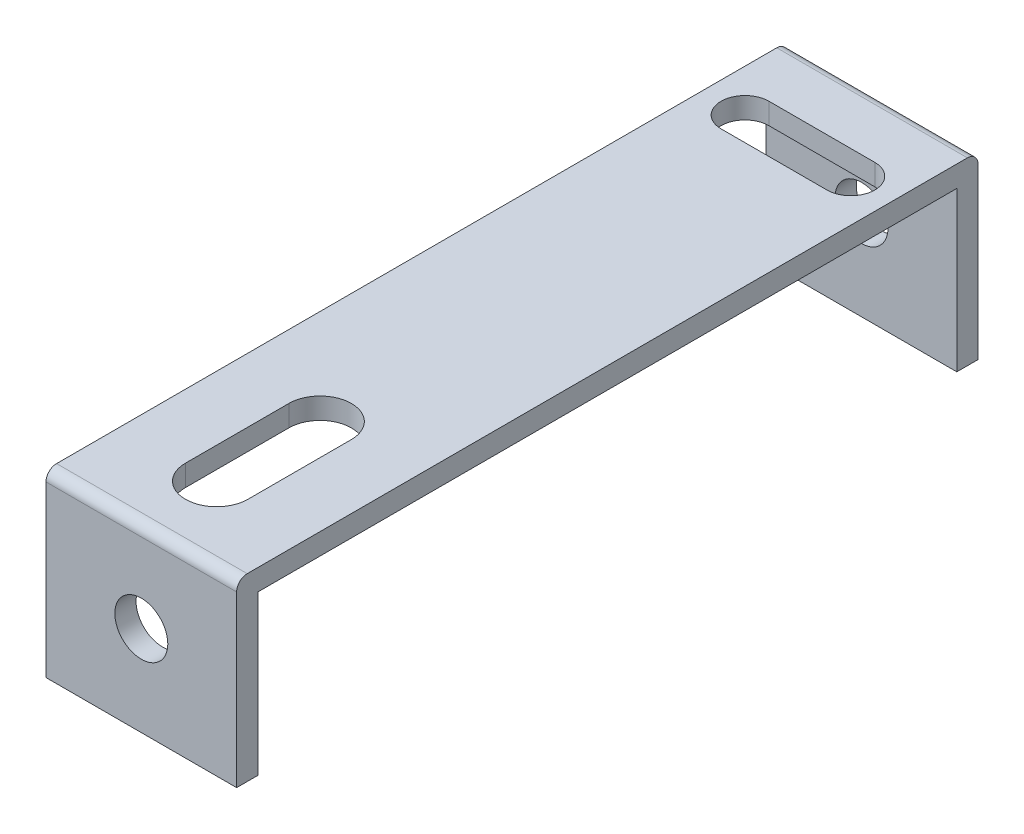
ISO-10303-21;
HEADER;
FILE_DESCRIPTION(('STEP AP214'),'2;1');
FILE_NAME('part.step','',(''),(''),'','','');
FILE_SCHEMA(('AUTOMOTIVE_DESIGN { 1 0 10303 214 1 1 1 1 }'));
ENDSEC;
DATA;
#1=APPLICATION_CONTEXT('core data for automotive mechanical design processes');
#2=APPLICATION_PROTOCOL_DEFINITION('international standard','automotive_design',2000,#1);
#3=PRODUCT_CONTEXT('',#1,'mechanical');
#4=PRODUCT('Part','Part','',(#3));
#5=PRODUCT_RELATED_PRODUCT_CATEGORY('part','',(#4));
#6=PRODUCT_DEFINITION_FORMATION('','',#4);
#7=PRODUCT_DEFINITION_CONTEXT('part definition',#1,'design');
#8=PRODUCT_DEFINITION('design','',#6,#7);
#9=PRODUCT_DEFINITION_SHAPE('','',#8);
#10=(LENGTH_UNIT() NAMED_UNIT(*) SI_UNIT(.MILLI.,.METRE.));
#11=(NAMED_UNIT(*) PLANE_ANGLE_UNIT() SI_UNIT($,.RADIAN.));
#12=(NAMED_UNIT(*) SI_UNIT($,.STERADIAN.) SOLID_ANGLE_UNIT());
#13=UNCERTAINTY_MEASURE_WITH_UNIT(LENGTH_MEASURE(1.E-05),#10,'distance_accuracy_value','');
#14=(GEOMETRIC_REPRESENTATION_CONTEXT(3) GLOBAL_UNCERTAINTY_ASSIGNED_CONTEXT((#13)) GLOBAL_UNIT_ASSIGNED_CONTEXT((#10,
#11,#12)) REPRESENTATION_CONTEXT('',''));
#15=CARTESIAN_POINT('',(0.,0.,0.));
#16=DIRECTION('',(0.,0.,1.));
#17=DIRECTION('',(1.,0.,0.));
#18=AXIS2_PLACEMENT_3D('',#15,#16,#17);
#19=CARTESIAN_POINT('',(18.,0.,-38.));
#20=DIRECTION('',(0.,0.,1.));
#21=DIRECTION('',(1.,0.,0.));
#22=AXIS2_PLACEMENT_3D('',#19,#20,#21);
#23=PLANE('',#22);
#24=CARTESIAN_POINT('',(8.99999999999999,-8.49999999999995,-38.));
#25=DIRECTION('',(0.,0.,1.));
#26=DIRECTION('',(1.,0.,0.));
#27=AXIS2_PLACEMENT_3D('',#24,#25,#26);
#28=CIRCLE('',#27,2.5);
#29=CARTESIAN_POINT('',(11.5,-8.49999999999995,-38.));
#30=VERTEX_POINT('',#29);
#31=EDGE_CURVE('E225',#30,#30,#28,.T.);
#32=ORIENTED_EDGE('',*,*,#31,.T.);
#33=EDGE_LOOP('',(#32));
#34=FACE_BOUND('',#33,.T.);
#35=DIRECTION('',(0.,1.,0.));
#36=VECTOR('',#35,1.);
#37=CARTESIAN_POINT('',(0.,0.,-38.));
#38=LINE('',#37,#36);
#39=CARTESIAN_POINT('',(0.,-16.9999999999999,-38.));
#40=VERTEX_POINT('',#39);
#41=CARTESIAN_POINT('',(0.,-0.99999999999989,-38.));
#42=VERTEX_POINT('',#41);
#43=EDGE_CURVE('E232',#40,#42,#38,.T.);
#44=ORIENTED_EDGE('',*,*,#43,.T.);
#45=DIRECTION('',(-1.,0.,0.));
#46=VECTOR('',#45,1.);
#47=CARTESIAN_POINT('',(18.,-0.99999999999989,-38.));
#48=LINE('',#47,#46);
#49=CARTESIAN_POINT('',(18.,-0.99999999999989,-38.));
#50=VERTEX_POINT('',#49);
#51=EDGE_CURVE('E297',#42,#50,#48,.F.);
#52=ORIENTED_EDGE('',*,*,#51,.T.);
#53=DIRECTION('',(0.,1.,0.));
#54=VECTOR('',#53,1.);
#55=CARTESIAN_POINT('',(18.,0.,-38.));
#56=LINE('',#55,#54);
#57=CARTESIAN_POINT('',(18.,-16.9999999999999,-38.));
#58=VERTEX_POINT('',#57);
#59=EDGE_CURVE('E233',#58,#50,#56,.T.);
#60=ORIENTED_EDGE('',*,*,#59,.F.);
#61=DIRECTION('',(-1.,0.,0.));
#62=VECTOR('',#61,1.);
#63=CARTESIAN_POINT('',(18.,-16.9999999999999,-38.));
#64=LINE('',#63,#62);
#65=EDGE_CURVE('E252',#58,#40,#64,.T.);
#66=ORIENTED_EDGE('',*,*,#65,.T.);
#67=EDGE_LOOP('',(#44,#52,#60,#66));
#68=FACE_BOUND('',#67,.T.);
#69=ADVANCED_FACE('F46',(#34,#68),#23,.F.);
#70=CARTESIAN_POINT('',(18.,0.,32.));
#71=DIRECTION('',(0.,-1.,0.));
#72=DIRECTION('',(0.,0.,-1.));
#73=AXIS2_PLACEMENT_3D('',#70,#71,#72);
#74=PLANE('',#73);
#75=DIRECTION('',(-1.,0.,0.));
#76=VECTOR('',#75,1.);
#77=CARTESIAN_POINT('',(14.,0.,-32.2595339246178));
#78=LINE('',#77,#76);
#79=CARTESIAN_POINT('',(14.,0.,-32.2595339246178));
#80=VERTEX_POINT('',#79);
#81=CARTESIAN_POINT('',(4.,0.,-32.2595339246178));
#82=VERTEX_POINT('',#81);
#83=EDGE_CURVE('E188',#80,#82,#78,.T.);
#84=ORIENTED_EDGE('',*,*,#83,.F.);
#85=CARTESIAN_POINT('',(14.,0.,-30.));
#86=DIRECTION('',(0.,1.,0.));
#87=DIRECTION('',(0.,0.,1.));
#88=AXIS2_PLACEMENT_3D('',#85,#86,#87);
#89=CIRCLE('',#88,2.25953392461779);
#90=CARTESIAN_POINT('',(14.,0.,-27.7404660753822));
#91=VERTEX_POINT('',#90);
#92=EDGE_CURVE('E61',#91,#80,#89,.T.);
#93=ORIENTED_EDGE('',*,*,#92,.F.);
#94=DIRECTION('',(1.,0.,0.));
#95=VECTOR('',#94,1.);
#96=CARTESIAN_POINT('',(14.,0.,-27.7404660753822));
#97=LINE('',#96,#95);
#98=CARTESIAN_POINT('',(3.99999999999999,0.,-27.7404660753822));
#99=VERTEX_POINT('',#98);
#100=EDGE_CURVE('E195',#99,#91,#97,.T.);
#101=ORIENTED_EDGE('',*,*,#100,.F.);
#102=CARTESIAN_POINT('',(4.,0.,-30.));
#103=DIRECTION('',(0.,1.,0.));
#104=DIRECTION('',(0.,0.,1.));
#105=AXIS2_PLACEMENT_3D('',#102,#103,#104);
#106=CIRCLE('',#105,2.25953392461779);
#107=EDGE_CURVE('E178',#82,#99,#106,.T.);
#108=ORIENTED_EDGE('',*,*,#107,.F.);
#109=EDGE_LOOP('',(#84,#93,#101,#108));
#110=FACE_BOUND('',#109,.T.);
#111=DIRECTION('',(0.,0.,-1.));
#112=VECTOR('',#111,1.);
#113=CARTESIAN_POINT('',(11.9516802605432,0.,24.8840557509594));
#114=LINE('',#113,#112);
#115=CARTESIAN_POINT('',(11.9516802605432,0.,24.8840557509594));
#116=VERTEX_POINT('',#115);
#117=CARTESIAN_POINT('',(11.9516802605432,0.,15.1159442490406));
#118=VERTEX_POINT('',#117);
#119=EDGE_CURVE('E206',#116,#118,#114,.T.);
#120=ORIENTED_EDGE('',*,*,#119,.F.);
#121=CARTESIAN_POINT('',(8.99999999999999,0.,24.8840557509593));
#122=DIRECTION('',(0.,1.,0.));
#123=DIRECTION('',(0.,0.,1.));
#124=AXIS2_PLACEMENT_3D('',#121,#122,#123);
#125=CIRCLE('',#124,2.95168026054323);
#126=CARTESIAN_POINT('',(6.04831973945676,0.,24.8840557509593));
#127=VERTEX_POINT('',#126);
#128=EDGE_CURVE('E69',#127,#116,#125,.T.);
#129=ORIENTED_EDGE('',*,*,#128,.F.);
#130=DIRECTION('',(0.,0.,1.));
#131=VECTOR('',#130,1.);
#132=CARTESIAN_POINT('',(6.04831973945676,0.,24.8840557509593));
#133=LINE('',#132,#131);
#134=CARTESIAN_POINT('',(6.04831973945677,0.,15.1159442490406));
#135=VERTEX_POINT('',#134);
#136=EDGE_CURVE('E212',#135,#127,#133,.T.);
#137=ORIENTED_EDGE('',*,*,#136,.F.);
#138=CARTESIAN_POINT('',(8.99999999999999,0.,15.1159442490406));
#139=DIRECTION('',(0.,1.,0.));
#140=DIRECTION('',(0.,0.,1.));
#141=AXIS2_PLACEMENT_3D('',#138,#139,#140);
#142=CIRCLE('',#141,2.95168026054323);
#143=EDGE_CURVE('E209',#118,#135,#142,.T.);
#144=ORIENTED_EDGE('',*,*,#143,.F.);
#145=EDGE_LOOP('',(#120,#129,#137,#144));
#146=FACE_BOUND('',#145,.T.);
#147=DIRECTION('',(0.,0.,1.));
#148=VECTOR('',#147,1.);
#149=CARTESIAN_POINT('',(18.,0.,32.));
#150=LINE('',#149,#148);
#151=CARTESIAN_POINT('',(18.,0.,-37.));
#152=VERTEX_POINT('',#151);
#153=CARTESIAN_POINT('',(18.,0.,31.));
#154=VERTEX_POINT('',#153);
#155=EDGE_CURVE('E236',#152,#154,#150,.T.);
#156=ORIENTED_EDGE('',*,*,#155,.F.);
#157=DIRECTION('',(-1.,0.,0.));
#158=VECTOR('',#157,1.);
#159=CARTESIAN_POINT('',(18.,0.,-37.));
#160=LINE('',#159,#158);
#161=CARTESIAN_POINT('',(0.,0.,-37.));
#162=VERTEX_POINT('',#161);
#163=EDGE_CURVE('E290',#152,#162,#160,.T.);
#164=ORIENTED_EDGE('',*,*,#163,.T.);
#165=DIRECTION('',(0.,0.,1.));
#166=VECTOR('',#165,1.);
#167=CARTESIAN_POINT('',(0.,0.,32.0000000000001));
#168=LINE('',#167,#166);
#169=CARTESIAN_POINT('',(0.,0.,31.));
#170=VERTEX_POINT('',#169);
#171=EDGE_CURVE('E255',#162,#170,#168,.T.);
#172=ORIENTED_EDGE('',*,*,#171,.T.);
#173=DIRECTION('',(-1.,0.,0.));
#174=VECTOR('',#173,1.);
#175=CARTESIAN_POINT('',(18.,0.,31.));
#176=LINE('',#175,#174);
#177=EDGE_CURVE('E286',#170,#154,#176,.F.);
#178=ORIENTED_EDGE('',*,*,#177,.T.);
#179=EDGE_LOOP('',(#156,#164,#172,#178));
#180=FACE_BOUND('',#179,.T.);
#181=ADVANCED_FACE('F192',(#110,#146,#180),#74,.F.);
#182=CARTESIAN_POINT('',(18.,0.,32.));
#183=DIRECTION('',(0.,0.,-1.));
#184=DIRECTION('',(-1.,0.,0.));
#185=AXIS2_PLACEMENT_3D('',#182,#183,#184);
#186=PLANE('',#185);
#187=CARTESIAN_POINT('',(8.99999999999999,-8.49999999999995,32.));
#188=DIRECTION('',(0.,0.,1.));
#189=DIRECTION('',(1.,0.,0.));
#190=AXIS2_PLACEMENT_3D('',#187,#188,#189);
#191=CIRCLE('',#190,2.5);
#192=CARTESIAN_POINT('',(11.5,-8.49999999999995,32.));
#193=VERTEX_POINT('',#192);
#194=EDGE_CURVE('E202',#193,#193,#191,.T.);
#195=ORIENTED_EDGE('',*,*,#194,.F.);
#196=EDGE_LOOP('',(#195));
#197=FACE_BOUND('',#196,.T.);
#198=DIRECTION('',(0.,-1.,0.));
#199=VECTOR('',#198,1.);
#200=CARTESIAN_POINT('',(18.,0.,32.));
#201=LINE('',#200,#199);
#202=CARTESIAN_POINT('',(18.,-1.00000000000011,32.));
#203=VERTEX_POINT('',#202);
#204=CARTESIAN_POINT('',(18.,-17.0000000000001,32.));
#205=VERTEX_POINT('',#204);
#206=EDGE_CURVE('E240',#203,#205,#201,.T.);
#207=ORIENTED_EDGE('',*,*,#206,.F.);
#208=DIRECTION('',(-1.,0.,0.));
#209=VECTOR('',#208,1.);
#210=CARTESIAN_POINT('',(18.,-1.00000000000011,32.));
#211=LINE('',#210,#209);
#212=CARTESIAN_POINT('',(0.,-1.00000000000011,32.0000000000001));
#213=VERTEX_POINT('',#212);
#214=EDGE_CURVE('E303',#203,#213,#211,.T.);
#215=ORIENTED_EDGE('',*,*,#214,.T.);
#216=DIRECTION('',(0.,-1.,0.));
#217=VECTOR('',#216,1.);
#218=CARTESIAN_POINT('',(0.,0.,32.0000000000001));
#219=LINE('',#218,#217);
#220=CARTESIAN_POINT('',(0.,-17.0000000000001,32.0000000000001));
#221=VERTEX_POINT('',#220);
#222=EDGE_CURVE('E258',#213,#221,#219,.T.);
#223=ORIENTED_EDGE('',*,*,#222,.T.);
#224=DIRECTION('',(-1.,0.,0.));
#225=VECTOR('',#224,1.);
#226=CARTESIAN_POINT('',(18.,-17.0000000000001,32.));
#227=LINE('',#226,#225);
#228=EDGE_CURVE('E283',#205,#221,#227,.T.);
#229=ORIENTED_EDGE('',*,*,#228,.F.);
#230=EDGE_LOOP('',(#207,#215,#223,#229));
#231=FACE_BOUND('',#230,.T.);
#232=ADVANCED_FACE('F347',(#197,#231),#186,.F.);
#233=CARTESIAN_POINT('',(18.,-17.0000000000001,32.));
#234=DIRECTION('',(0.,1.,0.));
#235=DIRECTION('',(0.,0.,1.));
#236=AXIS2_PLACEMENT_3D('',#233,#234,#235);
#237=PLANE('',#236);
#238=DIRECTION('',(0.,0.,-1.));
#239=VECTOR('',#238,1.);
#240=CARTESIAN_POINT('',(0.,-17.0000000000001,32.0000000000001));
#241=LINE('',#240,#239);
#242=CARTESIAN_POINT('',(0.,-17.0000000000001,30.));
#243=VERTEX_POINT('',#242);
#244=EDGE_CURVE('E260',#221,#243,#241,.T.);
#245=ORIENTED_EDGE('',*,*,#244,.T.);
#246=DIRECTION('',(-1.,0.,0.));
#247=VECTOR('',#246,1.);
#248=CARTESIAN_POINT('',(18.,-17.0000000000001,30.));
#249=LINE('',#248,#247);
#250=CARTESIAN_POINT('',(18.,-17.0000000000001,30.));
#251=VERTEX_POINT('',#250);
#252=EDGE_CURVE('E280',#251,#243,#249,.T.);
#253=ORIENTED_EDGE('',*,*,#252,.F.);
#254=DIRECTION('',(0.,0.,-1.));
#255=VECTOR('',#254,1.);
#256=CARTESIAN_POINT('',(18.,-17.0000000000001,32.));
#257=LINE('',#256,#255);
#258=EDGE_CURVE('E242',#205,#251,#257,.T.);
#259=ORIENTED_EDGE('',*,*,#258,.F.);
#260=ORIENTED_EDGE('',*,*,#228,.T.);
#261=EDGE_LOOP('',(#245,#253,#259,#260));
#262=FACE_BOUND('',#261,.T.);
#263=ADVANCED_FACE('F384',(#262),#237,.F.);
#264=CARTESIAN_POINT('',(18.,-17.0000000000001,30.));
#265=DIRECTION('',(0.,0.,1.));
#266=DIRECTION('',(1.,0.,0.));
#267=AXIS2_PLACEMENT_3D('',#264,#265,#266);
#268=PLANE('',#267);
#269=CARTESIAN_POINT('',(8.99999999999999,-8.49999999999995,30.));
#270=DIRECTION('',(0.,0.,1.));
#271=DIRECTION('',(1.,0.,0.));
#272=AXIS2_PLACEMENT_3D('',#269,#270,#271);
#273=CIRCLE('',#272,2.5);
#274=CARTESIAN_POINT('',(11.5,-8.49999999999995,30.));
#275=VERTEX_POINT('',#274);
#276=EDGE_CURVE('E229',#275,#275,#273,.T.);
#277=ORIENTED_EDGE('',*,*,#276,.T.);
#278=EDGE_LOOP('',(#277));
#279=FACE_BOUND('',#278,.T.);
#280=DIRECTION('',(0.,1.,0.));
#281=VECTOR('',#280,1.);
#282=CARTESIAN_POINT('',(0.,-17.0000000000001,30.));
#283=LINE('',#282,#281);
#284=CARTESIAN_POINT('',(0.,-2.,30.));
#285=VERTEX_POINT('',#284);
#286=EDGE_CURVE('E262',#243,#285,#283,.T.);
#287=ORIENTED_EDGE('',*,*,#286,.T.);
#288=DIRECTION('',(-1.,0.,0.));
#289=VECTOR('',#288,1.);
#290=CARTESIAN_POINT('',(18.,-2.,30.));
#291=LINE('',#290,#289);
#292=CARTESIAN_POINT('',(18.,-2.,30.));
#293=VERTEX_POINT('',#292);
#294=EDGE_CURVE('E277',#293,#285,#291,.T.);
#295=ORIENTED_EDGE('',*,*,#294,.F.);
#296=DIRECTION('',(0.,1.,0.));
#297=VECTOR('',#296,1.);
#298=CARTESIAN_POINT('',(18.,-17.0000000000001,30.));
#299=LINE('',#298,#297);
#300=EDGE_CURVE('E244',#251,#293,#299,.T.);
#301=ORIENTED_EDGE('',*,*,#300,.F.);
#302=ORIENTED_EDGE('',*,*,#252,.T.);
#303=EDGE_LOOP('',(#287,#295,#301,#302));
#304=FACE_BOUND('',#303,.T.);
#305=ADVANCED_FACE('F390',(#279,#304),#268,.F.);
#306=CARTESIAN_POINT('',(18.,-2.,-36.));
#307=DIRECTION('',(0.,1.,0.));
#308=DIRECTION('',(0.,0.,1.));
#309=AXIS2_PLACEMENT_3D('',#306,#307,#308);
#310=PLANE('',#309);
#311=DIRECTION('',(1.,0.,0.));
#312=VECTOR('',#311,1.);
#313=CARTESIAN_POINT('',(18.,-2.,-27.7404660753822));
#314=LINE('',#313,#312);
#315=CARTESIAN_POINT('',(3.99999999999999,-2.,-27.7404660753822));
#316=VERTEX_POINT('',#315);
#317=CARTESIAN_POINT('',(14.,-2.,-27.7404660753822));
#318=VERTEX_POINT('',#317);
#319=EDGE_CURVE('E54',#316,#318,#314,.T.);
#320=ORIENTED_EDGE('',*,*,#319,.T.);
#321=CARTESIAN_POINT('',(14.,-2.,-30.));
#322=DIRECTION('',(0.,1.,0.));
#323=DIRECTION('',(0.,0.,1.));
#324=AXIS2_PLACEMENT_3D('',#321,#322,#323);
#325=CIRCLE('',#324,2.25953392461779);
#326=CARTESIAN_POINT('',(14.,-2.,-32.2595339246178));
#327=VERTEX_POINT('',#326);
#328=EDGE_CURVE('E13',#318,#327,#325,.T.);
#329=ORIENTED_EDGE('',*,*,#328,.T.);
#330=DIRECTION('',(-1.,0.,0.));
#331=VECTOR('',#330,1.);
#332=CARTESIAN_POINT('',(18.,-2.,-32.2595339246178));
#333=LINE('',#332,#331);
#334=CARTESIAN_POINT('',(4.,-2.,-32.2595339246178));
#335=VERTEX_POINT('',#334);
#336=EDGE_CURVE('E318',#327,#335,#333,.T.);
#337=ORIENTED_EDGE('',*,*,#336,.T.);
#338=CARTESIAN_POINT('',(4.,-2.,-30.));
#339=DIRECTION('',(0.,1.,0.));
#340=DIRECTION('',(0.,0.,1.));
#341=AXIS2_PLACEMENT_3D('',#338,#339,#340);
#342=CIRCLE('',#341,2.25953392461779);
#343=EDGE_CURVE('E181',#335,#316,#342,.T.);
#344=ORIENTED_EDGE('',*,*,#343,.T.);
#345=EDGE_LOOP('',(#320,#329,#337,#344));
#346=FACE_BOUND('',#345,.T.);
#347=DIRECTION('',(0.,0.,1.));
#348=VECTOR('',#347,1.);
#349=CARTESIAN_POINT('',(6.04831973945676,-2.,-36.));
#350=LINE('',#349,#348);
#351=CARTESIAN_POINT('',(6.04831973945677,-2.,15.1159442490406));
#352=VERTEX_POINT('',#351);
#353=CARTESIAN_POINT('',(6.04831973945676,-2.,24.8840557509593));
#354=VERTEX_POINT('',#353);
#355=EDGE_CURVE('E312',#352,#354,#350,.T.);
#356=ORIENTED_EDGE('',*,*,#355,.T.);
#357=CARTESIAN_POINT('',(8.99999999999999,-2.,24.8840557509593));
#358=DIRECTION('',(0.,1.,0.));
#359=DIRECTION('',(0.,0.,1.));
#360=AXIS2_PLACEMENT_3D('',#357,#358,#359);
#361=CIRCLE('',#360,2.95168026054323);
#362=CARTESIAN_POINT('',(11.9516802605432,-2.,24.8840557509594));
#363=VERTEX_POINT('',#362);
#364=EDGE_CURVE('E315',#354,#363,#361,.T.);
#365=ORIENTED_EDGE('',*,*,#364,.T.);
#366=DIRECTION('',(0.,0.,-1.));
#367=VECTOR('',#366,1.);
#368=CARTESIAN_POINT('',(11.9516802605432,-2.,-36.));
#369=LINE('',#368,#367);
#370=CARTESIAN_POINT('',(11.9516802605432,-2.,15.1159442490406));
#371=VERTEX_POINT('',#370);
#372=EDGE_CURVE('E306',#363,#371,#369,.T.);
#373=ORIENTED_EDGE('',*,*,#372,.T.);
#374=CARTESIAN_POINT('',(8.99999999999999,-2.,15.1159442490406));
#375=DIRECTION('',(0.,1.,0.));
#376=DIRECTION('',(0.,0.,1.));
#377=AXIS2_PLACEMENT_3D('',#374,#375,#376);
#378=CIRCLE('',#377,2.95168026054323);
#379=EDGE_CURVE('E309',#371,#352,#378,.T.);
#380=ORIENTED_EDGE('',*,*,#379,.T.);
#381=EDGE_LOOP('',(#356,#365,#373,#380));
#382=FACE_BOUND('',#381,.T.);
#383=DIRECTION('',(0.,0.,-1.));
#384=VECTOR('',#383,1.);
#385=CARTESIAN_POINT('',(0.,-2.,-36.));
#386=LINE('',#385,#384);
#387=CARTESIAN_POINT('',(0.,-2.,-36.));
#388=VERTEX_POINT('',#387);
#389=EDGE_CURVE('E264',#285,#388,#386,.T.);
#390=ORIENTED_EDGE('',*,*,#389,.T.);
#391=DIRECTION('',(-1.,0.,0.));
#392=VECTOR('',#391,1.);
#393=CARTESIAN_POINT('',(18.,-2.,-36.));
#394=LINE('',#393,#392);
#395=CARTESIAN_POINT('',(18.,-2.,-36.));
#396=VERTEX_POINT('',#395);
#397=EDGE_CURVE('E274',#396,#388,#394,.T.);
#398=ORIENTED_EDGE('',*,*,#397,.F.);
#399=DIRECTION('',(0.,0.,-1.));
#400=VECTOR('',#399,1.);
#401=CARTESIAN_POINT('',(18.,-2.,-36.));
#402=LINE('',#401,#400);
#403=EDGE_CURVE('E246',#293,#396,#402,.T.);
#404=ORIENTED_EDGE('',*,*,#403,.F.);
#405=ORIENTED_EDGE('',*,*,#294,.T.);
#406=EDGE_LOOP('',(#390,#398,#404,#405));
#407=FACE_BOUND('',#406,.T.);
#408=ADVANCED_FACE('F322',(#346,#382,#407),#310,.F.);
#409=CARTESIAN_POINT('',(18.,-16.9999999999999,-36.));
#410=DIRECTION('',(0.,0.,-1.));
#411=DIRECTION('',(0.,1.,0.));
#412=AXIS2_PLACEMENT_3D('',#409,#410,#411);
#413=PLANE('',#412);
#414=CARTESIAN_POINT('',(9.,-8.49999999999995,-36.));
#415=DIRECTION('',(0.,0.,-1.));
#416=DIRECTION('',(0.,1.,0.));
#417=AXIS2_PLACEMENT_3D('',#414,#415,#416);
#418=CIRCLE('',#417,2.5);
#419=CARTESIAN_POINT('',(9.,-5.99999999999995,-36.));
#420=VERTEX_POINT('',#419);
#421=EDGE_CURVE('E228',#420,#420,#418,.T.);
#422=ORIENTED_EDGE('',*,*,#421,.T.);
#423=EDGE_LOOP('',(#422));
#424=FACE_BOUND('',#423,.T.);
#425=DIRECTION('',(0.,-1.,0.));
#426=VECTOR('',#425,1.);
#427=CARTESIAN_POINT('',(0.,-16.9999999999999,-36.));
#428=LINE('',#427,#426);
#429=CARTESIAN_POINT('',(0.,-16.9999999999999,-36.));
#430=VERTEX_POINT('',#429);
#431=EDGE_CURVE('E266',#388,#430,#428,.T.);
#432=ORIENTED_EDGE('',*,*,#431,.T.);
#433=DIRECTION('',(-1.,0.,0.));
#434=VECTOR('',#433,1.);
#435=CARTESIAN_POINT('',(18.,-16.9999999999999,-36.));
#436=LINE('',#435,#434);
#437=CARTESIAN_POINT('',(18.,-16.9999999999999,-36.));
#438=VERTEX_POINT('',#437);
#439=EDGE_CURVE('E271',#438,#430,#436,.T.);
#440=ORIENTED_EDGE('',*,*,#439,.F.);
#441=DIRECTION('',(0.,-1.,0.));
#442=VECTOR('',#441,1.);
#443=CARTESIAN_POINT('',(18.,-16.9999999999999,-36.));
#444=LINE('',#443,#442);
#445=EDGE_CURVE('E248',#396,#438,#444,.T.);
#446=ORIENTED_EDGE('',*,*,#445,.F.);
#447=ORIENTED_EDGE('',*,*,#397,.T.);
#448=EDGE_LOOP('',(#432,#440,#446,#447));
#449=FACE_BOUND('',#448,.T.);
#450=ADVANCED_FACE('F398',(#424,#449),#413,.F.);
#451=CARTESIAN_POINT('',(18.,-16.9999999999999,-38.));
#452=DIRECTION('',(0.,1.,0.));
#453=DIRECTION('',(0.,0.,1.));
#454=AXIS2_PLACEMENT_3D('',#451,#452,#453);
#455=PLANE('',#454);
#456=DIRECTION('',(0.,0.,-1.));
#457=VECTOR('',#456,1.);
#458=CARTESIAN_POINT('',(0.,-16.9999999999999,-38.));
#459=LINE('',#458,#457);
#460=EDGE_CURVE('E237',#430,#40,#459,.T.);
#461=ORIENTED_EDGE('',*,*,#460,.T.);
#462=ORIENTED_EDGE('',*,*,#65,.F.);
#463=DIRECTION('',(0.,0.,-1.));
#464=VECTOR('',#463,1.);
#465=CARTESIAN_POINT('',(18.,-16.9999999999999,-38.));
#466=LINE('',#465,#464);
#467=EDGE_CURVE('E250',#438,#58,#466,.T.);
#468=ORIENTED_EDGE('',*,*,#467,.F.);
#469=ORIENTED_EDGE('',*,*,#439,.T.);
#470=EDGE_LOOP('',(#461,#462,#468,#469));
#471=FACE_BOUND('',#470,.T.);
#472=ADVANCED_FACE('F402',(#471),#455,.F.);
#473=CARTESIAN_POINT('',(18.,0.,0.));
#474=DIRECTION('',(-1.,0.,0.));
#475=DIRECTION('',(0.,0.,1.));
#476=AXIS2_PLACEMENT_3D('',#473,#474,#475);
#477=PLANE('',#476);
#478=ORIENTED_EDGE('',*,*,#59,.T.);
#479=CARTESIAN_POINT('',(18.,-0.99999999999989,-37.));
#480=DIRECTION('',(-1.,0.,0.));
#481=DIRECTION('',(0.,0.,1.));
#482=AXIS2_PLACEMENT_3D('',#479,#480,#481);
#483=CIRCLE('',#482,1.);
#484=EDGE_CURVE('E301',#50,#152,#483,.F.);
#485=ORIENTED_EDGE('',*,*,#484,.T.);
#486=ORIENTED_EDGE('',*,*,#155,.T.);
#487=CARTESIAN_POINT('',(18.,-1.00000000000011,31.));
#488=DIRECTION('',(-1.,0.,0.));
#489=DIRECTION('',(0.,0.,1.));
#490=AXIS2_PLACEMENT_3D('',#487,#488,#489);
#491=CIRCLE('',#490,1.);
#492=EDGE_CURVE('E299',#154,#203,#491,.F.);
#493=ORIENTED_EDGE('',*,*,#492,.T.);
#494=ORIENTED_EDGE('',*,*,#206,.T.);
#495=ORIENTED_EDGE('',*,*,#258,.T.);
#496=ORIENTED_EDGE('',*,*,#300,.T.);
#497=ORIENTED_EDGE('',*,*,#403,.T.);
#498=ORIENTED_EDGE('',*,*,#445,.T.);
#499=ORIENTED_EDGE('',*,*,#467,.T.);
#500=EDGE_LOOP('',(#478,#485,#486,#493,#494,#495,#496,#497,#498,#499));
#501=FACE_BOUND('',#500,.T.);
#502=ADVANCED_FACE('F369',(#501),#477,.F.);
#503=CARTESIAN_POINT('',(0.,0.,0.));
#504=DIRECTION('',(-1.,0.,0.));
#505=DIRECTION('',(0.,0.,1.));
#506=AXIS2_PLACEMENT_3D('',#503,#504,#505);
#507=PLANE('',#506);
#508=ORIENTED_EDGE('',*,*,#171,.F.);
#509=CARTESIAN_POINT('',(0.,-0.99999999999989,-37.));
#510=DIRECTION('',(-1.,0.,0.));
#511=DIRECTION('',(0.,0.,1.));
#512=AXIS2_PLACEMENT_3D('',#509,#510,#511);
#513=CIRCLE('',#512,1.);
#514=EDGE_CURVE('E295',#162,#42,#513,.T.);
#515=ORIENTED_EDGE('',*,*,#514,.T.);
#516=ORIENTED_EDGE('',*,*,#43,.F.);
#517=ORIENTED_EDGE('',*,*,#460,.F.);
#518=ORIENTED_EDGE('',*,*,#431,.F.);
#519=ORIENTED_EDGE('',*,*,#389,.F.);
#520=ORIENTED_EDGE('',*,*,#286,.F.);
#521=ORIENTED_EDGE('',*,*,#244,.F.);
#522=ORIENTED_EDGE('',*,*,#222,.F.);
#523=CARTESIAN_POINT('',(0.,-1.00000000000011,31.));
#524=DIRECTION('',(-1.,0.,0.));
#525=DIRECTION('',(0.,0.,1.));
#526=AXIS2_PLACEMENT_3D('',#523,#524,#525);
#527=CIRCLE('',#526,1.);
#528=EDGE_CURVE('E293',#213,#170,#527,.T.);
#529=ORIENTED_EDGE('',*,*,#528,.T.);
#530=EDGE_LOOP('',(#508,#515,#516,#517,#518,#519,#520,#521,#522,#529));
#531=FACE_BOUND('',#530,.T.);
#532=ADVANCED_FACE('F406',(#531),#507,.T.);
#533=CARTESIAN_POINT('',(8.99999999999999,-8.49999999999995,-38.));
#534=DIRECTION('',(0.,0.,1.));
#535=DIRECTION('',(1.,0.,0.));
#536=AXIS2_PLACEMENT_3D('',#533,#534,#535);
#537=CYLINDRICAL_SURFACE('',#536,2.5);
#538=ORIENTED_EDGE('',*,*,#31,.F.);
#539=EDGE_LOOP('',(#538));
#540=FACE_BOUND('',#539,.T.);
#541=ORIENTED_EDGE('',*,*,#421,.F.);
#542=EDGE_LOOP('',(#541));
#543=FACE_BOUND('',#542,.T.);
#544=ADVANCED_FACE('F361',(#540,#543),#537,.F.);
#545=ORIENTED_EDGE('',*,*,#194,.T.);
#546=EDGE_LOOP('',(#545));
#547=FACE_BOUND('',#546,.T.);
#548=ORIENTED_EDGE('',*,*,#276,.F.);
#549=EDGE_LOOP('',(#548));
#550=FACE_BOUND('',#549,.T.);
#551=ADVANCED_FACE('F353',(#547,#550),#537,.F.);
#552=CARTESIAN_POINT('',(18.,-0.99999999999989,-37.));
#553=DIRECTION('',(-1.,0.,0.));
#554=DIRECTION('',(0.,0.,1.));
#555=AXIS2_PLACEMENT_3D('',#552,#553,#554);
#556=CYLINDRICAL_SURFACE('',#555,1.);
#557=ORIENTED_EDGE('',*,*,#484,.F.);
#558=ORIENTED_EDGE('',*,*,#51,.F.);
#559=ORIENTED_EDGE('',*,*,#514,.F.);
#560=ORIENTED_EDGE('',*,*,#163,.F.);
#561=EDGE_LOOP('',(#557,#558,#559,#560));
#562=FACE_BOUND('',#561,.T.);
#563=ADVANCED_FACE('F351',(#562),#556,.T.);
#564=CARTESIAN_POINT('',(18.,-1.00000000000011,31.));
#565=DIRECTION('',(-1.,0.,0.));
#566=DIRECTION('',(0.,0.,1.));
#567=AXIS2_PLACEMENT_3D('',#564,#565,#566);
#568=CYLINDRICAL_SURFACE('',#567,1.);
#569=ORIENTED_EDGE('',*,*,#492,.F.);
#570=ORIENTED_EDGE('',*,*,#177,.F.);
#571=ORIENTED_EDGE('',*,*,#528,.F.);
#572=ORIENTED_EDGE('',*,*,#214,.F.);
#573=EDGE_LOOP('',(#569,#570,#571,#572));
#574=FACE_BOUND('',#573,.T.);
#575=ADVANCED_FACE('F48',(#574),#568,.T.);
#576=CARTESIAN_POINT('',(8.99999999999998,-10.,24.8840557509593));
#577=DIRECTION('',(0.,1.,0.));
#578=DIRECTION('',(0.,0.,1.));
#579=AXIS2_PLACEMENT_3D('',#576,#577,#578);
#580=CYLINDRICAL_SURFACE('',#579,2.95168026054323);
#581=DIRECTION('',(0.,1.,0.));
#582=VECTOR('',#581,1.);
#583=CARTESIAN_POINT('',(6.04831973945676,-10.,24.8840557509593));
#584=LINE('',#583,#582);
#585=EDGE_CURVE('E216',#354,#127,#584,.T.);
#586=ORIENTED_EDGE('',*,*,#585,.T.);
#587=ORIENTED_EDGE('',*,*,#128,.T.);
#588=DIRECTION('',(0.,1.,0.));
#589=VECTOR('',#588,1.);
#590=CARTESIAN_POINT('',(11.9516802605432,-10.,24.8840557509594));
#591=LINE('',#590,#589);
#592=EDGE_CURVE('E215',#363,#116,#591,.T.);
#593=ORIENTED_EDGE('',*,*,#592,.F.);
#594=ORIENTED_EDGE('',*,*,#364,.F.);
#595=EDGE_LOOP('',(#586,#587,#593,#594));
#596=FACE_BOUND('',#595,.T.);
#597=ADVANCED_FACE('F359',(#596),#580,.F.);
#598=CARTESIAN_POINT('',(6.04831973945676,-10.,24.8840557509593));
#599=DIRECTION('',(-1.,0.,0.));
#600=DIRECTION('',(0.,0.,1.));
#601=AXIS2_PLACEMENT_3D('',#598,#599,#600);
#602=PLANE('',#601);
#603=DIRECTION('',(0.,1.,0.));
#604=VECTOR('',#603,1.);
#605=CARTESIAN_POINT('',(6.04831973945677,-10.,15.1159442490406));
#606=LINE('',#605,#604);
#607=EDGE_CURVE('E218',#352,#135,#606,.T.);
#608=ORIENTED_EDGE('',*,*,#607,.T.);
#609=ORIENTED_EDGE('',*,*,#136,.T.);
#610=ORIENTED_EDGE('',*,*,#585,.F.);
#611=ORIENTED_EDGE('',*,*,#355,.F.);
#612=EDGE_LOOP('',(#608,#609,#610,#611));
#613=FACE_BOUND('',#612,.T.);
#614=ADVANCED_FACE('F483',(#613),#602,.F.);
#615=CARTESIAN_POINT('',(8.99999999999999,-10.,15.1159442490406));
#616=DIRECTION('',(0.,1.,0.));
#617=DIRECTION('',(0.,0.,1.));
#618=AXIS2_PLACEMENT_3D('',#615,#616,#617);
#619=CYLINDRICAL_SURFACE('',#618,2.95168026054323);
#620=DIRECTION('',(0.,1.,0.));
#621=VECTOR('',#620,1.);
#622=CARTESIAN_POINT('',(11.9516802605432,-10.,15.1159442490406));
#623=LINE('',#622,#621);
#624=EDGE_CURVE('E220',#371,#118,#623,.T.);
#625=ORIENTED_EDGE('',*,*,#624,.T.);
#626=ORIENTED_EDGE('',*,*,#143,.T.);
#627=ORIENTED_EDGE('',*,*,#607,.F.);
#628=ORIENTED_EDGE('',*,*,#379,.F.);
#629=EDGE_LOOP('',(#625,#626,#627,#628));
#630=FACE_BOUND('',#629,.T.);
#631=ADVANCED_FACE('F336',(#630),#619,.F.);
#632=CARTESIAN_POINT('',(11.9516802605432,-10.,24.8840557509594));
#633=DIRECTION('',(1.,0.,0.));
#634=DIRECTION('',(0.,0.,-1.));
#635=AXIS2_PLACEMENT_3D('',#632,#633,#634);
#636=PLANE('',#635);
#637=ORIENTED_EDGE('',*,*,#592,.T.);
#638=ORIENTED_EDGE('',*,*,#119,.T.);
#639=ORIENTED_EDGE('',*,*,#624,.F.);
#640=ORIENTED_EDGE('',*,*,#372,.F.);
#641=EDGE_LOOP('',(#637,#638,#639,#640));
#642=FACE_BOUND('',#641,.T.);
#643=ADVANCED_FACE('F329',(#642),#636,.F.);
#644=CARTESIAN_POINT('',(14.,-10.,-30.));
#645=DIRECTION('',(0.,1.,0.));
#646=DIRECTION('',(0.,0.,1.));
#647=AXIS2_PLACEMENT_3D('',#644,#645,#646);
#648=CYLINDRICAL_SURFACE('',#647,2.25953392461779);
#649=DIRECTION('',(0.,1.,0.));
#650=VECTOR('',#649,1.);
#651=CARTESIAN_POINT('',(14.,-10.,-27.7404660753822));
#652=LINE('',#651,#650);
#653=EDGE_CURVE('E200',#318,#91,#652,.T.);
#654=ORIENTED_EDGE('',*,*,#653,.T.);
#655=ORIENTED_EDGE('',*,*,#92,.T.);
#656=DIRECTION('',(0.,1.,0.));
#657=VECTOR('',#656,1.);
#658=CARTESIAN_POINT('',(14.,-10.,-32.2595339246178));
#659=LINE('',#658,#657);
#660=EDGE_CURVE('E185',#327,#80,#659,.T.);
#661=ORIENTED_EDGE('',*,*,#660,.F.);
#662=ORIENTED_EDGE('',*,*,#328,.F.);
#663=EDGE_LOOP('',(#654,#655,#661,#662));
#664=FACE_BOUND('',#663,.T.);
#665=ADVANCED_FACE('F327',(#664),#648,.F.);
#666=CARTESIAN_POINT('',(14.,-10.,-27.7404660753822));
#667=DIRECTION('',(0.,0.,1.));
#668=DIRECTION('',(1.,0.,0.));
#669=AXIS2_PLACEMENT_3D('',#666,#667,#668);
#670=PLANE('',#669);
#671=DIRECTION('',(0.,1.,0.));
#672=VECTOR('',#671,1.);
#673=CARTESIAN_POINT('',(4.,-10.,-27.7404660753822));
#674=LINE('',#673,#672);
#675=EDGE_CURVE('E184',#316,#99,#674,.T.);
#676=ORIENTED_EDGE('',*,*,#675,.T.);
#677=ORIENTED_EDGE('',*,*,#100,.T.);
#678=ORIENTED_EDGE('',*,*,#653,.F.);
#679=ORIENTED_EDGE('',*,*,#319,.F.);
#680=EDGE_LOOP('',(#676,#677,#678,#679));
#681=FACE_BOUND('',#680,.T.);
#682=ADVANCED_FACE('F326',(#681),#670,.F.);
#683=CARTESIAN_POINT('',(4.,-10.,-30.));
#684=DIRECTION('',(0.,1.,0.));
#685=DIRECTION('',(0.,0.,1.));
#686=AXIS2_PLACEMENT_3D('',#683,#684,#685);
#687=CYLINDRICAL_SURFACE('',#686,2.25953392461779);
#688=DIRECTION('',(0.,1.,0.));
#689=VECTOR('',#688,1.);
#690=CARTESIAN_POINT('',(4.,-10.,-32.2595339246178));
#691=LINE('',#690,#689);
#692=EDGE_CURVE('E173',#335,#82,#691,.T.);
#693=ORIENTED_EDGE('',*,*,#692,.T.);
#694=ORIENTED_EDGE('',*,*,#107,.T.);
#695=ORIENTED_EDGE('',*,*,#675,.F.);
#696=ORIENTED_EDGE('',*,*,#343,.F.);
#697=EDGE_LOOP('',(#693,#694,#695,#696));
#698=FACE_BOUND('',#697,.T.);
#699=ADVANCED_FACE('F175',(#698),#687,.F.);
#700=CARTESIAN_POINT('',(14.,-10.,-32.2595339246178));
#701=DIRECTION('',(0.,0.,-1.));
#702=DIRECTION('',(-1.,0.,0.));
#703=AXIS2_PLACEMENT_3D('',#700,#701,#702);
#704=PLANE('',#703);
#705=ORIENTED_EDGE('',*,*,#660,.T.);
#706=ORIENTED_EDGE('',*,*,#83,.T.);
#707=ORIENTED_EDGE('',*,*,#692,.F.);
#708=ORIENTED_EDGE('',*,*,#336,.F.);
#709=EDGE_LOOP('',(#705,#706,#707,#708));
#710=FACE_BOUND('',#709,.T.);
#711=ADVANCED_FACE('F189',(#710),#704,.F.);
#712=CLOSED_SHELL('',(#69,#181,#232,#263,#305,#408,#450,#472,#502,#532,#544,#551,#563,#575,#597,
#614,#631,#643,#665,#682,#699,#711));
#713=MANIFOLD_SOLID_BREP('B2',#712);
#714=ADVANCED_BREP_SHAPE_REPRESENTATION('',(#18,#713),#14);
#715=SHAPE_DEFINITION_REPRESENTATION(#9,#714);
ENDSEC;
END-ISO-10303-21;
